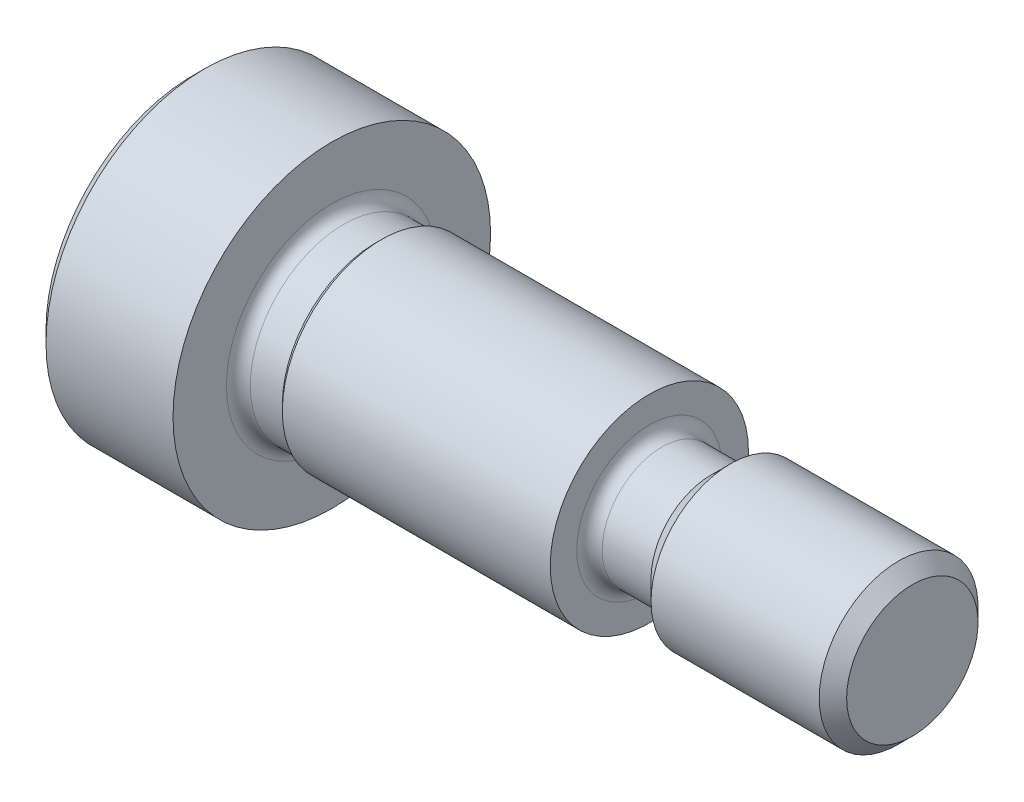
ISO-10303-21;
HEADER;
FILE_DESCRIPTION(('STEP AP214'),'2;1');
FILE_NAME('part.step','',(''),(''),'','','');
FILE_SCHEMA(('AUTOMOTIVE_DESIGN { 1 0 10303 214 1 1 1 1 }'));
ENDSEC;
DATA;
#1=APPLICATION_CONTEXT('core data for automotive mechanical design processes');
#2=APPLICATION_PROTOCOL_DEFINITION('international standard','automotive_design',2000,#1);
#3=PRODUCT_CONTEXT('',#1,'mechanical');
#4=PRODUCT('Part','Part','',(#3));
#5=PRODUCT_RELATED_PRODUCT_CATEGORY('part','',(#4));
#6=PRODUCT_DEFINITION_FORMATION('','',#4);
#7=PRODUCT_DEFINITION_CONTEXT('part definition',#1,'design');
#8=PRODUCT_DEFINITION('design','',#6,#7);
#9=PRODUCT_DEFINITION_SHAPE('','',#8);
#10=(LENGTH_UNIT() NAMED_UNIT(*) SI_UNIT(.MILLI.,.METRE.));
#11=(NAMED_UNIT(*) PLANE_ANGLE_UNIT() SI_UNIT($,.RADIAN.));
#12=(NAMED_UNIT(*) SI_UNIT($,.STERADIAN.) SOLID_ANGLE_UNIT());
#13=UNCERTAINTY_MEASURE_WITH_UNIT(LENGTH_MEASURE(1.E-05),#10,'distance_accuracy_value','');
#14=(GEOMETRIC_REPRESENTATION_CONTEXT(3) GLOBAL_UNCERTAINTY_ASSIGNED_CONTEXT((#13)) GLOBAL_UNIT_ASSIGNED_CONTEXT((#10,
#11,#12)) REPRESENTATION_CONTEXT('',''));
#15=CARTESIAN_POINT('',(0.,0.,0.));
#16=DIRECTION('',(0.,0.,1.));
#17=DIRECTION('',(1.,0.,0.));
#18=AXIS2_PLACEMENT_3D('',#15,#16,#17);
#19=CARTESIAN_POINT('',(0.,0.,0.));
#20=DIRECTION('',(-1.,0.,0.));
#21=DIRECTION('',(0.,0.,1.));
#22=AXIS2_PLACEMENT_3D('',#19,#20,#21);
#23=PLANE('',#22);
#24=CARTESIAN_POINT('',(0.,0.,0.));
#25=DIRECTION('',(-1.,0.,0.));
#26=DIRECTION('',(0.,0.,1.));
#27=AXIS2_PLACEMENT_3D('',#24,#25,#26);
#28=CIRCLE('',#27,7.4);
#29=CARTESIAN_POINT('',(0.,0.,-7.4));
#30=VERTEX_POINT('',#29);
#31=EDGE_CURVE('E38',#30,#30,#28,.T.);
#32=ORIENTED_EDGE('',*,*,#31,.T.);
#33=EDGE_LOOP('',(#32));
#34=FACE_BOUND('',#33,.T.);
#35=DIRECTION('',(0.,-0.500000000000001,-0.866025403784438));
#36=VECTOR('',#35,1.);
#37=CARTESIAN_POINT('',(0.,-1.47079981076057,2.5475));
#38=LINE('',#37,#36);
#39=CARTESIAN_POINT('',(0.,-1.47079981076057,2.5475));
#40=VERTEX_POINT('',#39);
#41=CARTESIAN_POINT('',(0.,-2.94159962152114,0.));
#42=VERTEX_POINT('',#41);
#43=EDGE_CURVE('E45',#40,#42,#38,.T.);
#44=ORIENTED_EDGE('',*,*,#43,.T.);
#45=DIRECTION('',(0.,0.5,-0.866025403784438));
#46=VECTOR('',#45,1.);
#47=CARTESIAN_POINT('',(0.,-2.94159962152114,0.));
#48=LINE('',#47,#46);
#49=CARTESIAN_POINT('',(0.,-1.47079981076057,-2.5475));
#50=VERTEX_POINT('',#49);
#51=EDGE_CURVE('E320',#42,#50,#48,.T.);
#52=ORIENTED_EDGE('',*,*,#51,.T.);
#53=DIRECTION('',(0.,1.,0.));
#54=VECTOR('',#53,1.);
#55=CARTESIAN_POINT('',(0.,-1.47079981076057,-2.5475));
#56=LINE('',#55,#54);
#57=CARTESIAN_POINT('',(0.,1.47079981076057,-2.5475));
#58=VERTEX_POINT('',#57);
#59=EDGE_CURVE('E125',#50,#58,#56,.T.);
#60=ORIENTED_EDGE('',*,*,#59,.T.);
#61=DIRECTION('',(0.,0.500000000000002,0.866025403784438));
#62=VECTOR('',#61,1.);
#63=CARTESIAN_POINT('',(0.,1.47079981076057,-2.5475));
#64=LINE('',#63,#62);
#65=CARTESIAN_POINT('',(0.,2.94159962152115,0.));
#66=VERTEX_POINT('',#65);
#67=EDGE_CURVE('E323',#58,#66,#64,.T.);
#68=ORIENTED_EDGE('',*,*,#67,.T.);
#69=DIRECTION('',(0.,-0.500000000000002,0.866025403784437));
#70=VECTOR('',#69,1.);
#71=CARTESIAN_POINT('',(0.,2.94159962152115,0.));
#72=LINE('',#71,#70);
#73=CARTESIAN_POINT('',(0.,1.47079981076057,2.5475));
#74=VERTEX_POINT('',#73);
#75=EDGE_CURVE('E325',#66,#74,#72,.T.);
#76=ORIENTED_EDGE('',*,*,#75,.T.);
#77=DIRECTION('',(0.,-1.,0.));
#78=VECTOR('',#77,1.);
#79=CARTESIAN_POINT('',(0.,1.47079981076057,2.5475));
#80=LINE('',#79,#78);
#81=EDGE_CURVE('E327',#74,#40,#80,.T.);
#82=ORIENTED_EDGE('',*,*,#81,.T.);
#83=EDGE_LOOP('',(#44,#52,#60,#68,#76,#82));
#84=FACE_BOUND('',#83,.T.);
#85=ADVANCED_FACE('F30',(#34,#84),#23,.T.);
#86=CARTESIAN_POINT('',(-6.34999999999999,0.,0.));
#87=DIRECTION('',(-1.,0.,0.));
#88=DIRECTION('',(0.,0.,1.));
#89=AXIS2_PLACEMENT_3D('',#86,#87,#88);
#90=CYLINDRICAL_SURFACE('',#89,8.);
#91=CARTESIAN_POINT('',(0.600000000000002,0.,0.));
#92=DIRECTION('',(-1.,0.,0.));
#93=DIRECTION('',(0.,0.,1.));
#94=AXIS2_PLACEMENT_3D('',#91,#92,#93);
#95=CIRCLE('',#94,8.);
#96=CARTESIAN_POINT('',(0.600000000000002,0.,-8.));
#97=VERTEX_POINT('',#96);
#98=EDGE_CURVE('E11',#97,#97,#95,.F.);
#99=ORIENTED_EDGE('',*,*,#98,.T.);
#100=EDGE_LOOP('',(#99));
#101=FACE_BOUND('',#100,.T.);
#102=CARTESIAN_POINT('',(7.,0.,0.));
#103=DIRECTION('',(-1.,0.,0.));
#104=DIRECTION('',(0.,0.,1.));
#105=AXIS2_PLACEMENT_3D('',#102,#103,#104);
#106=CIRCLE('',#105,8.);
#107=CARTESIAN_POINT('',(7.,0.,8.));
#108=VERTEX_POINT('',#107);
#109=EDGE_CURVE('E172',#108,#108,#106,.T.);
#110=ORIENTED_EDGE('',*,*,#109,.T.);
#111=EDGE_LOOP('',(#110));
#112=FACE_BOUND('',#111,.T.);
#113=ADVANCED_FACE('F191',(#101,#112),#90,.T.);
#114=CARTESIAN_POINT('',(7.,8.,0.));
#115=DIRECTION('',(1.,0.,0.));
#116=DIRECTION('',(0.,0.,-1.));
#117=AXIS2_PLACEMENT_3D('',#114,#115,#116);
#118=PLANE('',#117);
#119=CARTESIAN_POINT('',(7.,0.,0.));
#120=DIRECTION('',(-1.,0.,0.));
#121=DIRECTION('',(0.,0.,1.));
#122=AXIS2_PLACEMENT_3D('',#119,#120,#121);
#123=CIRCLE('',#122,5.31);
#124=CARTESIAN_POINT('',(7.,0.,5.31));
#125=VERTEX_POINT('',#124);
#126=EDGE_CURVE('E169',#125,#125,#123,.T.);
#127=ORIENTED_EDGE('',*,*,#126,.T.);
#128=EDGE_LOOP('',(#127));
#129=FACE_BOUND('',#128,.T.);
#130=ORIENTED_EDGE('',*,*,#109,.F.);
#131=EDGE_LOOP('',(#130));
#132=FACE_BOUND('',#131,.T.);
#133=ADVANCED_FACE('F195',(#129,#132),#118,.T.);
#134=CARTESIAN_POINT('',(7.6,0.,0.));
#135=DIRECTION('',(-1.,0.,0.));
#136=DIRECTION('',(0.,0.,1.));
#137=AXIS2_PLACEMENT_3D('',#134,#135,#136);
#138=TOROIDAL_SURFACE('',#137,5.31,0.6);
#139=ORIENTED_EDGE('',*,*,#126,.F.);
#140=EDGE_LOOP('',(#139));
#141=FACE_BOUND('',#140,.T.);
#142=CARTESIAN_POINT('',(7.6,0.,0.));
#143=DIRECTION('',(-1.,0.,0.));
#144=DIRECTION('',(0.,0.,1.));
#145=AXIS2_PLACEMENT_3D('',#142,#143,#144);
#146=CIRCLE('',#145,4.71);
#147=CARTESIAN_POINT('',(7.6,0.,4.71));
#148=VERTEX_POINT('',#147);
#149=EDGE_CURVE('E166',#148,#148,#146,.T.);
#150=ORIENTED_EDGE('',*,*,#149,.T.);
#151=EDGE_LOOP('',(#150));
#152=FACE_BOUND('',#151,.T.);
#153=ADVANCED_FACE('F201',(#141,#152),#138,.F.);
#154=CARTESIAN_POINT('',(-6.34999999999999,0.,0.));
#155=DIRECTION('',(-1.,0.,0.));
#156=DIRECTION('',(0.,0.,1.));
#157=AXIS2_PLACEMENT_3D('',#154,#155,#156);
#158=CYLINDRICAL_SURFACE('',#157,4.71);
#159=CARTESIAN_POINT('',(9.2165,0.,0.));
#160=DIRECTION('',(-1.,0.,0.));
#161=DIRECTION('',(0.,0.,1.));
#162=AXIS2_PLACEMENT_3D('',#159,#160,#161);
#163=CIRCLE('',#162,4.71);
#164=CARTESIAN_POINT('',(9.2165,0.,4.71));
#165=VERTEX_POINT('',#164);
#166=EDGE_CURVE('E163',#165,#165,#163,.T.);
#167=ORIENTED_EDGE('',*,*,#166,.T.);
#168=EDGE_LOOP('',(#167));
#169=FACE_BOUND('',#168,.T.);
#170=ORIENTED_EDGE('',*,*,#149,.F.);
#171=EDGE_LOOP('',(#170));
#172=FACE_BOUND('',#171,.T.);
#173=ADVANCED_FACE('F205',(#169,#172),#158,.T.);
#174=CARTESIAN_POINT('',(9.2165,0.,0.));
#175=DIRECTION('',(1.,0.,0.));
#176=DIRECTION('',(0.,0.,-1.));
#177=AXIS2_PLACEMENT_3D('',#174,#175,#176);
#178=CONICAL_SURFACE('',#177,4.71,0.785398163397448);
#179=CARTESIAN_POINT('',(9.5,0.,0.));
#180=DIRECTION('',(-1.,0.,0.));
#181=DIRECTION('',(0.,0.,1.));
#182=AXIS2_PLACEMENT_3D('',#179,#180,#181);
#183=CIRCLE('',#182,4.9935);
#184=CARTESIAN_POINT('',(9.5,0.,4.9935));
#185=VERTEX_POINT('',#184);
#186=EDGE_CURVE('E160',#185,#185,#183,.T.);
#187=ORIENTED_EDGE('',*,*,#186,.T.);
#188=EDGE_LOOP('',(#187));
#189=FACE_BOUND('',#188,.T.);
#190=ORIENTED_EDGE('',*,*,#166,.F.);
#191=EDGE_LOOP('',(#190));
#192=FACE_BOUND('',#191,.T.);
#193=ADVANCED_FACE('F209',(#189,#192),#178,.T.);
#194=CARTESIAN_POINT('',(-6.34999999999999,0.,0.));
#195=DIRECTION('',(-1.,0.,0.));
#196=DIRECTION('',(0.,0.,1.));
#197=AXIS2_PLACEMENT_3D('',#194,#195,#196);
#198=CYLINDRICAL_SURFACE('',#197,4.9935);
#199=CARTESIAN_POINT('',(23.,0.,0.));
#200=DIRECTION('',(-1.,0.,0.));
#201=DIRECTION('',(0.,0.,1.));
#202=AXIS2_PLACEMENT_3D('',#199,#200,#201);
#203=CIRCLE('',#202,4.9935);
#204=CARTESIAN_POINT('',(23.,0.,4.9935));
#205=VERTEX_POINT('',#204);
#206=EDGE_CURVE('E157',#205,#205,#203,.T.);
#207=ORIENTED_EDGE('',*,*,#206,.T.);
#208=EDGE_LOOP('',(#207));
#209=FACE_BOUND('',#208,.T.);
#210=ORIENTED_EDGE('',*,*,#186,.F.);
#211=EDGE_LOOP('',(#210));
#212=FACE_BOUND('',#211,.T.);
#213=ADVANCED_FACE('F213',(#209,#212),#198,.T.);
#214=CARTESIAN_POINT('',(23.,4.9935,0.));
#215=DIRECTION('',(1.,0.,0.));
#216=DIRECTION('',(0.,0.,-1.));
#217=AXIS2_PLACEMENT_3D('',#214,#215,#216);
#218=PLANE('',#217);
#219=CARTESIAN_POINT('',(23.,0.,0.));
#220=DIRECTION('',(-1.,0.,0.));
#221=DIRECTION('',(0.,0.,1.));
#222=AXIS2_PLACEMENT_3D('',#219,#220,#221);
#223=CIRCLE('',#222,3.655);
#224=CARTESIAN_POINT('',(23.,0.,3.655));
#225=VERTEX_POINT('',#224);
#226=EDGE_CURVE('E154',#225,#225,#223,.T.);
#227=ORIENTED_EDGE('',*,*,#226,.T.);
#228=EDGE_LOOP('',(#227));
#229=FACE_BOUND('',#228,.T.);
#230=ORIENTED_EDGE('',*,*,#206,.F.);
#231=EDGE_LOOP('',(#230));
#232=FACE_BOUND('',#231,.T.);
#233=ADVANCED_FACE('F217',(#229,#232),#218,.T.);
#234=CARTESIAN_POINT('',(23.64,0.,0.));
#235=DIRECTION('',(-1.,0.,0.));
#236=DIRECTION('',(0.,0.,1.));
#237=AXIS2_PLACEMENT_3D('',#234,#235,#236);
#238=TOROIDAL_SURFACE('',#237,3.655,0.640000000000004);
#239=CARTESIAN_POINT('',(23.64,0.,0.));
#240=DIRECTION('',(-1.,0.,0.));
#241=DIRECTION('',(0.,0.,1.));
#242=AXIS2_PLACEMENT_3D('',#239,#240,#241);
#243=CIRCLE('',#242,3.015);
#244=CARTESIAN_POINT('',(23.64,0.,3.015));
#245=VERTEX_POINT('',#244);
#246=EDGE_CURVE('E151',#245,#245,#243,.T.);
#247=ORIENTED_EDGE('',*,*,#246,.T.);
#248=EDGE_LOOP('',(#247));
#249=FACE_BOUND('',#248,.T.);
#250=ORIENTED_EDGE('',*,*,#226,.F.);
#251=EDGE_LOOP('',(#250));
#252=FACE_BOUND('',#251,.T.);
#253=ADVANCED_FACE('F221',(#249,#252),#238,.F.);
#254=CARTESIAN_POINT('',(-6.34999999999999,0.,0.));
#255=DIRECTION('',(-1.,0.,0.));
#256=DIRECTION('',(0.,0.,1.));
#257=AXIS2_PLACEMENT_3D('',#254,#255,#256);
#258=CYLINDRICAL_SURFACE('',#257,3.015);
#259=CARTESIAN_POINT('',(26.1,0.,0.));
#260=DIRECTION('',(-1.,0.,0.));
#261=DIRECTION('',(0.,0.,1.));
#262=AXIS2_PLACEMENT_3D('',#259,#260,#261);
#263=CIRCLE('',#262,3.015);
#264=CARTESIAN_POINT('',(26.1,0.,3.015));
#265=VERTEX_POINT('',#264);
#266=EDGE_CURVE('E148',#265,#265,#263,.T.);
#267=ORIENTED_EDGE('',*,*,#266,.T.);
#268=EDGE_LOOP('',(#267));
#269=FACE_BOUND('',#268,.T.);
#270=ORIENTED_EDGE('',*,*,#246,.F.);
#271=EDGE_LOOP('',(#270));
#272=FACE_BOUND('',#271,.T.);
#273=ADVANCED_FACE('F225',(#269,#272),#258,.T.);
#274=CARTESIAN_POINT('',(26.1,0.,0.));
#275=DIRECTION('',(1.,0.,0.));
#276=DIRECTION('',(0.,0.,-1.));
#277=AXIS2_PLACEMENT_3D('',#274,#275,#276);
#278=CONICAL_SURFACE('',#277,3.015,0.785398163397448);
#279=CARTESIAN_POINT('',(27.085,0.,0.));
#280=DIRECTION('',(-1.,0.,0.));
#281=DIRECTION('',(0.,0.,1.));
#282=AXIS2_PLACEMENT_3D('',#279,#280,#281);
#283=CIRCLE('',#282,4.);
#284=CARTESIAN_POINT('',(27.085,0.,4.));
#285=VERTEX_POINT('',#284);
#286=EDGE_CURVE('E145',#285,#285,#283,.T.);
#287=ORIENTED_EDGE('',*,*,#286,.T.);
#288=EDGE_LOOP('',(#287));
#289=FACE_BOUND('',#288,.T.);
#290=ORIENTED_EDGE('',*,*,#266,.F.);
#291=EDGE_LOOP('',(#290));
#292=FACE_BOUND('',#291,.T.);
#293=ADVANCED_FACE('F229',(#289,#292),#278,.T.);
#294=CARTESIAN_POINT('',(-6.34999999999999,0.,0.));
#295=DIRECTION('',(-1.,0.,0.));
#296=DIRECTION('',(0.,0.,1.));
#297=AXIS2_PLACEMENT_3D('',#294,#295,#296);
#298=CYLINDRICAL_SURFACE('',#297,4.);
#299=CARTESIAN_POINT('',(35.5595,0.,0.));
#300=DIRECTION('',(-1.,0.,0.));
#301=DIRECTION('',(0.,0.,1.));
#302=AXIS2_PLACEMENT_3D('',#299,#300,#301);
#303=CIRCLE('',#302,4.);
#304=CARTESIAN_POINT('',(35.5595,0.,4.));
#305=VERTEX_POINT('',#304);
#306=EDGE_CURVE('E142',#305,#305,#303,.T.);
#307=ORIENTED_EDGE('',*,*,#306,.T.);
#308=EDGE_LOOP('',(#307));
#309=FACE_BOUND('',#308,.T.);
#310=ORIENTED_EDGE('',*,*,#286,.F.);
#311=EDGE_LOOP('',(#310));
#312=FACE_BOUND('',#311,.T.);
#313=ADVANCED_FACE('F233',(#309,#312),#298,.T.);
#314=CARTESIAN_POINT('',(35.5595,0.,0.));
#315=DIRECTION('',(-1.,0.,0.));
#316=DIRECTION('',(0.,0.,1.));
#317=AXIS2_PLACEMENT_3D('',#314,#315,#316);
#318=CONICAL_SURFACE('',#317,4.,0.785398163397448);
#319=CARTESIAN_POINT('',(36.25,0.,0.));
#320=DIRECTION('',(-1.,0.,0.));
#321=DIRECTION('',(0.,0.,1.));
#322=AXIS2_PLACEMENT_3D('',#319,#320,#321);
#323=CIRCLE('',#322,3.3095);
#324=CARTESIAN_POINT('',(36.25,0.,3.3095));
#325=VERTEX_POINT('',#324);
#326=EDGE_CURVE('E138',#325,#325,#323,.T.);
#327=ORIENTED_EDGE('',*,*,#326,.T.);
#328=EDGE_LOOP('',(#327));
#329=FACE_BOUND('',#328,.T.);
#330=ORIENTED_EDGE('',*,*,#306,.F.);
#331=EDGE_LOOP('',(#330));
#332=FACE_BOUND('',#331,.T.);
#333=ADVANCED_FACE('F186',(#329,#332),#318,.T.);
#334=CARTESIAN_POINT('',(36.25,3.3095,0.));
#335=DIRECTION('',(1.,0.,0.));
#336=DIRECTION('',(0.,0.,-1.));
#337=AXIS2_PLACEMENT_3D('',#334,#335,#336);
#338=PLANE('',#337);
#339=ORIENTED_EDGE('',*,*,#326,.F.);
#340=EDGE_LOOP('',(#339));
#341=FACE_BOUND('',#340,.T.);
#342=ADVANCED_FACE('F179',(#341),#338,.T.);
#343=CARTESIAN_POINT('',(0.,0.,0.));
#344=DIRECTION('',(1.,0.,0.));
#345=DIRECTION('',(0.,0.,-1.));
#346=AXIS2_PLACEMENT_3D('',#343,#344,#345);
#347=CONICAL_SURFACE('',#346,7.4,0.785398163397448);
#348=CARTESIAN_POINT('',(0.600000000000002,0.,-8.));
#349=CARTESIAN_POINT('',(0.593750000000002,0.,-7.99375));
#350=CARTESIAN_POINT('',(0.587500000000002,0.,-7.9875));
#351=CARTESIAN_POINT('',(0.575000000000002,0.,-7.975));
#352=CARTESIAN_POINT('',(0.568750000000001,0.,-7.96875));
#353=CARTESIAN_POINT('',(0.556250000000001,0.,-7.95625));
#354=CARTESIAN_POINT('',(0.550000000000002,0.,-7.95));
#355=CARTESIAN_POINT('',(0.537500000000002,0.,-7.9375));
#356=CARTESIAN_POINT('',(0.531250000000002,0.,-7.93125));
#357=CARTESIAN_POINT('',(0.518750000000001,0.,-7.91875));
#358=CARTESIAN_POINT('',(0.512500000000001,0.,-7.9125));
#359=CARTESIAN_POINT('',(0.500000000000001,0.,-7.9));
#360=CARTESIAN_POINT('',(0.493750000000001,0.,-7.89375));
#361=CARTESIAN_POINT('',(0.481250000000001,0.,-7.88125));
#362=CARTESIAN_POINT('',(0.475000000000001,0.,-7.875));
#363=CARTESIAN_POINT('',(0.462500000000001,0.,-7.8625));
#364=CARTESIAN_POINT('',(0.456250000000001,0.,-7.85625));
#365=CARTESIAN_POINT('',(0.443750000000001,0.,-7.84375));
#366=CARTESIAN_POINT('',(0.437500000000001,0.,-7.8375));
#367=CARTESIAN_POINT('',(0.425000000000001,0.,-7.825));
#368=CARTESIAN_POINT('',(0.418750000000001,0.,-7.81875));
#369=CARTESIAN_POINT('',(0.406250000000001,0.,-7.80625));
#370=CARTESIAN_POINT('',(0.400000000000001,0.,-7.8));
#371=CARTESIAN_POINT('',(0.387500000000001,0.,-7.7875));
#372=CARTESIAN_POINT('',(0.381250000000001,0.,-7.78125));
#373=CARTESIAN_POINT('',(0.368750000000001,0.,-7.76875));
#374=CARTESIAN_POINT('',(0.362500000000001,0.,-7.7625));
#375=CARTESIAN_POINT('',(0.350000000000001,0.,-7.75));
#376=CARTESIAN_POINT('',(0.343750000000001,0.,-7.74375));
#377=CARTESIAN_POINT('',(0.331250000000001,0.,-7.73125));
#378=CARTESIAN_POINT('',(0.325000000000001,0.,-7.725));
#379=CARTESIAN_POINT('',(0.312500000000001,0.,-7.7125));
#380=CARTESIAN_POINT('',(0.306250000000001,0.,-7.70625));
#381=CARTESIAN_POINT('',(0.293750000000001,0.,-7.69375));
#382=CARTESIAN_POINT('',(0.287500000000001,0.,-7.6875));
#383=CARTESIAN_POINT('',(0.275000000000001,0.,-7.675));
#384=CARTESIAN_POINT('',(0.268750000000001,0.,-7.66875));
#385=CARTESIAN_POINT('',(0.256250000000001,0.,-7.65625));
#386=CARTESIAN_POINT('',(0.250000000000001,0.,-7.65));
#387=CARTESIAN_POINT('',(0.237500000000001,0.,-7.6375));
#388=CARTESIAN_POINT('',(0.231250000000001,0.,-7.63125));
#389=CARTESIAN_POINT('',(0.218750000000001,0.,-7.61875));
#390=CARTESIAN_POINT('',(0.2125,0.,-7.6125));
#391=CARTESIAN_POINT('',(0.200000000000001,0.,-7.6));
#392=CARTESIAN_POINT('',(0.193750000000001,0.,-7.59375));
#393=CARTESIAN_POINT('',(0.181250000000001,0.,-7.58125));
#394=CARTESIAN_POINT('',(0.175,0.,-7.575));
#395=CARTESIAN_POINT('',(0.1625,0.,-7.5625));
#396=CARTESIAN_POINT('',(0.15625,0.,-7.55625));
#397=CARTESIAN_POINT('',(0.143750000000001,0.,-7.54375));
#398=CARTESIAN_POINT('',(0.1375,0.,-7.5375));
#399=CARTESIAN_POINT('',(0.125,0.,-7.525));
#400=CARTESIAN_POINT('',(0.11875,0.,-7.51875));
#401=CARTESIAN_POINT('',(0.10625,0.,-7.50625));
#402=CARTESIAN_POINT('',(0.1,0.,-7.5));
#403=CARTESIAN_POINT('',(0.0875000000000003,0.,-7.4875));
#404=CARTESIAN_POINT('',(0.0812500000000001,0.,-7.48125));
#405=CARTESIAN_POINT('',(0.0687500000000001,0.,-7.46875));
#406=CARTESIAN_POINT('',(0.0625000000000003,0.,-7.4625));
#407=CARTESIAN_POINT('',(0.0500000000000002,0.,-7.45));
#408=CARTESIAN_POINT('',(0.0437500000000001,0.,-7.44375));
#409=CARTESIAN_POINT('',(0.03125,0.,-7.43125));
#410=CARTESIAN_POINT('',(0.0250000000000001,0.,-7.425));
#411=CARTESIAN_POINT('',(0.0125000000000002,0.,-7.4125));
#412=CARTESIAN_POINT('',(0.00625000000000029,0.,-7.40625));
#413=CARTESIAN_POINT('',(0.,0.,-7.4));
#414=B_SPLINE_CURVE_WITH_KNOTS('',3,(#348,#349,#350,#351,#352,#353,#354,#355,#356,#357,#358,
#359,#360,#361,#362,#363,#364,#365,#366,#367,#368,#369,#370,#371,#372,#373,#374,#375,#376,#377,
#378,#379,#380,#381,#382,#383,#384,#385,#386,#387,#388,#389,#390,#391,#392,#393,#394,#395,#396,
#397,#398,#399,#400,#401,#402,#403,#404,#405,#406,#407,#408,#409,#410,#411,#412,#413),
.UNSPECIFIED.,.F.,.F.,(4,2,2,2,2,2,2,2,2,2,2,2,2,2,2,2,2,2,2,2,2,2,2,2,2,2,2,2,2,2,2,2,4),(0.,
0.0265165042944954,0.0530330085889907,0.0795495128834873,0.106066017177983,0.132582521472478,
0.159099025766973,0.185615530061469,0.212132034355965,0.23864853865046,0.265165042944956,
0.291681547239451,0.318198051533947,0.344714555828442,0.371231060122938,0.397747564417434,
0.424264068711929,0.450780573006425,0.47729707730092,0.503813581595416,0.530330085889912,
0.556846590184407,0.583363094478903,0.609879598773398,0.636396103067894,0.66291260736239,
0.689429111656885,0.715945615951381,0.742462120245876,0.768978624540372,0.795495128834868,
0.822011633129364,0.848528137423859),.UNSPECIFIED.);
#415=EDGE_CURVE('BSEAM32',#97,#30,#414,.T.);
#416=ORIENTED_EDGE('',*,*,#98,.F.);
#417=ORIENTED_EDGE('',*,*,#31,.F.);
#418=ORIENTED_EDGE('',*,*,#415,.T.);
#419=ORIENTED_EDGE('',*,*,#415,.F.);
#420=EDGE_LOOP('',(#416,#418,#417,#419));
#421=FACE_BOUND('',#420,.T.);
#422=ADVANCED_FACE('F32',(#421),#347,.T.);
#423=CARTESIAN_POINT('',(4.2,-2.94159962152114,0.));
#424=DIRECTION('',(0.,0.866025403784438,0.500000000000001));
#425=DIRECTION('',(0.,-0.500000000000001,0.866025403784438));
#426=AXIS2_PLACEMENT_3D('',#423,#424,#425);
#427=PLANE('',#426);
#428=DIRECTION('',(0.,0.5,-0.866025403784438));
#429=VECTOR('',#428,1.);
#430=CARTESIAN_POINT('',(4.2,-2.94159962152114,0.));
#431=LINE('',#430,#429);
#432=CARTESIAN_POINT('',(4.2,-2.94159962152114,0.));
#433=VERTEX_POINT('',#432);
#434=CARTESIAN_POINT('',(4.2,-2.20619971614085,-1.27375));
#435=VERTEX_POINT('',#434);
#436=EDGE_CURVE('E53',#433,#435,#431,.T.);
#437=ORIENTED_EDGE('',*,*,#436,.T.);
#438=CARTESIAN_POINT('',(4.2,-1.47079981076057,-2.5475));
#439=VERTEX_POINT('',#438);
#440=EDGE_CURVE('E103',#435,#439,#431,.T.);
#441=ORIENTED_EDGE('',*,*,#440,.T.);
#442=DIRECTION('',(-1.,0.,0.));
#443=VECTOR('',#442,1.);
#444=CARTESIAN_POINT('',(4.2,-1.47079981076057,-2.5475));
#445=LINE('',#444,#443);
#446=EDGE_CURVE('E107',#439,#50,#445,.T.);
#447=ORIENTED_EDGE('',*,*,#446,.T.);
#448=ORIENTED_EDGE('',*,*,#51,.F.);
#449=DIRECTION('',(-1.,0.,0.));
#450=VECTOR('',#449,1.);
#451=CARTESIAN_POINT('',(4.2,-2.94159962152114,0.));
#452=LINE('',#451,#450);
#453=EDGE_CURVE('E319',#433,#42,#452,.T.);
#454=ORIENTED_EDGE('',*,*,#453,.F.);
#455=EDGE_LOOP('',(#437,#441,#447,#448,#454));
#456=FACE_BOUND('',#455,.T.);
#457=ADVANCED_FACE('F105',(#456),#427,.T.);
#458=CARTESIAN_POINT('',(4.2,-1.47079981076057,-2.5475));
#459=DIRECTION('',(0.,0.,1.));
#460=DIRECTION('',(0.,-1.,0.));
#461=AXIS2_PLACEMENT_3D('',#458,#459,#460);
#462=PLANE('',#461);
#463=DIRECTION('',(0.,1.,0.));
#464=VECTOR('',#463,1.);
#465=CARTESIAN_POINT('',(4.2,-1.47079981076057,-2.5475));
#466=LINE('',#465,#464);
#467=CARTESIAN_POINT('',(4.2,0.,-2.5475));
#468=VERTEX_POINT('',#467);
#469=EDGE_CURVE('E112',#439,#468,#466,.T.);
#470=ORIENTED_EDGE('',*,*,#469,.T.);
#471=CARTESIAN_POINT('',(4.2,1.47079981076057,-2.5475));
#472=VERTEX_POINT('',#471);
#473=EDGE_CURVE('E120',#468,#472,#466,.T.);
#474=ORIENTED_EDGE('',*,*,#473,.T.);
#475=DIRECTION('',(-1.,0.,0.));
#476=VECTOR('',#475,1.);
#477=CARTESIAN_POINT('',(4.2,1.47079981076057,-2.5475));
#478=LINE('',#477,#476);
#479=EDGE_CURVE('E127',#472,#58,#478,.T.);
#480=ORIENTED_EDGE('',*,*,#479,.T.);
#481=ORIENTED_EDGE('',*,*,#59,.F.);
#482=ORIENTED_EDGE('',*,*,#446,.F.);
#483=EDGE_LOOP('',(#470,#474,#480,#481,#482));
#484=FACE_BOUND('',#483,.T.);
#485=ADVANCED_FACE('F123',(#484),#462,.T.);
#486=CARTESIAN_POINT('',(4.2,1.47079981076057,-2.5475));
#487=DIRECTION('',(0.,-0.866025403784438,0.500000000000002));
#488=DIRECTION('',(0.,-0.500000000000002,-0.866025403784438));
#489=AXIS2_PLACEMENT_3D('',#486,#487,#488);
#490=PLANE('',#489);
#491=DIRECTION('',(0.,0.500000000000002,0.866025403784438));
#492=VECTOR('',#491,1.);
#493=CARTESIAN_POINT('',(4.2,1.47079981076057,-2.5475));
#494=LINE('',#493,#492);
#495=CARTESIAN_POINT('',(4.2,2.20619971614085,-1.27375));
#496=VERTEX_POINT('',#495);
#497=EDGE_CURVE('E283',#472,#496,#494,.T.);
#498=ORIENTED_EDGE('',*,*,#497,.T.);
#499=CARTESIAN_POINT('',(4.2,2.94159962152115,0.));
#500=VERTEX_POINT('',#499);
#501=EDGE_CURVE('E119',#496,#500,#494,.T.);
#502=ORIENTED_EDGE('',*,*,#501,.T.);
#503=DIRECTION('',(-1.,0.,0.));
#504=VECTOR('',#503,1.);
#505=CARTESIAN_POINT('',(4.2,2.94159962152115,0.));
#506=LINE('',#505,#504);
#507=EDGE_CURVE('E133',#500,#66,#506,.T.);
#508=ORIENTED_EDGE('',*,*,#507,.T.);
#509=ORIENTED_EDGE('',*,*,#67,.F.);
#510=ORIENTED_EDGE('',*,*,#479,.F.);
#511=EDGE_LOOP('',(#498,#502,#508,#509,#510));
#512=FACE_BOUND('',#511,.T.);
#513=ADVANCED_FACE('F247',(#512),#490,.T.);
#514=CARTESIAN_POINT('',(4.2,2.94159962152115,0.));
#515=DIRECTION('',(0.,-0.866025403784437,-0.500000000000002));
#516=DIRECTION('',(0.,0.500000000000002,-0.866025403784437));
#517=AXIS2_PLACEMENT_3D('',#514,#515,#516);
#518=PLANE('',#517);
#519=DIRECTION('',(0.,-0.500000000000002,0.866025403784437));
#520=VECTOR('',#519,1.);
#521=CARTESIAN_POINT('',(4.2,2.94159962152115,0.));
#522=LINE('',#521,#520);
#523=CARTESIAN_POINT('',(4.2,2.20619971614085,1.27375));
#524=VERTEX_POINT('',#523);
#525=EDGE_CURVE('E288',#500,#524,#522,.T.);
#526=ORIENTED_EDGE('',*,*,#525,.T.);
#527=CARTESIAN_POINT('',(4.2,1.47079981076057,2.5475));
#528=VERTEX_POINT('',#527);
#529=EDGE_CURVE('E294',#524,#528,#522,.T.);
#530=ORIENTED_EDGE('',*,*,#529,.T.);
#531=DIRECTION('',(-1.,0.,0.));
#532=VECTOR('',#531,1.);
#533=CARTESIAN_POINT('',(4.2,1.47079981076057,2.5475));
#534=LINE('',#533,#532);
#535=EDGE_CURVE('E314',#528,#74,#534,.T.);
#536=ORIENTED_EDGE('',*,*,#535,.T.);
#537=ORIENTED_EDGE('',*,*,#75,.F.);
#538=ORIENTED_EDGE('',*,*,#507,.F.);
#539=EDGE_LOOP('',(#526,#530,#536,#537,#538));
#540=FACE_BOUND('',#539,.T.);
#541=ADVANCED_FACE('F250',(#540),#518,.T.);
#542=CARTESIAN_POINT('',(4.2,1.47079981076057,2.5475));
#543=DIRECTION('',(0.,0.,-1.));
#544=DIRECTION('',(-1.,0.,0.));
#545=AXIS2_PLACEMENT_3D('',#542,#543,#544);
#546=PLANE('',#545);
#547=DIRECTION('',(0.,-1.,0.));
#548=VECTOR('',#547,1.);
#549=CARTESIAN_POINT('',(4.2,1.47079981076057,2.5475));
#550=LINE('',#549,#548);
#551=CARTESIAN_POINT('',(4.2,0.,2.5475));
#552=VERTEX_POINT('',#551);
#553=EDGE_CURVE('E301',#528,#552,#550,.T.);
#554=ORIENTED_EDGE('',*,*,#553,.T.);
#555=CARTESIAN_POINT('',(4.2,-1.47079981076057,2.5475));
#556=VERTEX_POINT('',#555);
#557=EDGE_CURVE('E304',#552,#556,#550,.T.);
#558=ORIENTED_EDGE('',*,*,#557,.T.);
#559=DIRECTION('',(-1.,0.,0.));
#560=VECTOR('',#559,1.);
#561=CARTESIAN_POINT('',(4.2,-1.47079981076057,2.5475));
#562=LINE('',#561,#560);
#563=EDGE_CURVE('E332',#556,#40,#562,.T.);
#564=ORIENTED_EDGE('',*,*,#563,.T.);
#565=ORIENTED_EDGE('',*,*,#81,.F.);
#566=ORIENTED_EDGE('',*,*,#535,.F.);
#567=EDGE_LOOP('',(#554,#558,#564,#565,#566));
#568=FACE_BOUND('',#567,.T.);
#569=ADVANCED_FACE('F254',(#568),#546,.T.);
#570=CARTESIAN_POINT('',(4.2,-1.47079981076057,2.5475));
#571=DIRECTION('',(0.,0.866025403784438,-0.500000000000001));
#572=DIRECTION('',(0.,0.500000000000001,0.866025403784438));
#573=AXIS2_PLACEMENT_3D('',#570,#571,#572);
#574=PLANE('',#573);
#575=DIRECTION('',(0.,-0.500000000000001,-0.866025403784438));
#576=VECTOR('',#575,1.);
#577=CARTESIAN_POINT('',(4.2,-1.47079981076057,2.5475));
#578=LINE('',#577,#576);
#579=CARTESIAN_POINT('',(4.2,-2.20619971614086,1.27375));
#580=VERTEX_POINT('',#579);
#581=EDGE_CURVE('E307',#556,#580,#578,.T.);
#582=ORIENTED_EDGE('',*,*,#581,.T.);
#583=EDGE_CURVE('E315',#580,#433,#578,.T.);
#584=ORIENTED_EDGE('',*,*,#583,.T.);
#585=ORIENTED_EDGE('',*,*,#453,.T.);
#586=ORIENTED_EDGE('',*,*,#43,.F.);
#587=ORIENTED_EDGE('',*,*,#563,.F.);
#588=EDGE_LOOP('',(#582,#584,#585,#586,#587));
#589=FACE_BOUND('',#588,.T.);
#590=ADVANCED_FACE('F258',(#589),#574,.T.);
#591=CARTESIAN_POINT('',(4.2,0.,-5.09499999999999));
#592=DIRECTION('',(1.,0.,0.));
#593=DIRECTION('',(0.,0.,-1.));
#594=AXIS2_PLACEMENT_3D('',#591,#592,#593);
#595=PLANE('',#594);
#596=CARTESIAN_POINT('',(4.2,0.,0.));
#597=DIRECTION('',(-1.,0.,0.));
#598=DIRECTION('',(0.,0.,1.));
#599=AXIS2_PLACEMENT_3D('',#596,#597,#598);
#600=CIRCLE('',#599,2.5475);
#601=EDGE_CURVE('E280',#496,#468,#600,.T.);
#602=ORIENTED_EDGE('',*,*,#601,.F.);
#603=ORIENTED_EDGE('',*,*,#497,.F.);
#604=ORIENTED_EDGE('',*,*,#473,.F.);
#605=EDGE_LOOP('',(#602,#603,#604));
#606=FACE_BOUND('',#605,.T.);
#607=ADVANCED_FACE('F262',(#606),#595,.F.);
#608=EDGE_CURVE('E139',#524,#496,#600,.T.);
#609=ORIENTED_EDGE('',*,*,#608,.F.);
#610=ORIENTED_EDGE('',*,*,#525,.F.);
#611=ORIENTED_EDGE('',*,*,#501,.F.);
#612=EDGE_LOOP('',(#609,#610,#611));
#613=FACE_BOUND('',#612,.T.);
#614=ADVANCED_FACE('F272',(#613),#595,.F.);
#615=EDGE_CURVE('E132',#552,#524,#600,.T.);
#616=ORIENTED_EDGE('',*,*,#615,.F.);
#617=ORIENTED_EDGE('',*,*,#553,.F.);
#618=ORIENTED_EDGE('',*,*,#529,.F.);
#619=EDGE_LOOP('',(#616,#617,#618));
#620=FACE_BOUND('',#619,.T.);
#621=ADVANCED_FACE('F277',(#620),#595,.F.);
#622=EDGE_CURVE('E126',#580,#552,#600,.T.);
#623=ORIENTED_EDGE('',*,*,#622,.F.);
#624=ORIENTED_EDGE('',*,*,#581,.F.);
#625=ORIENTED_EDGE('',*,*,#557,.F.);
#626=EDGE_LOOP('',(#623,#624,#625));
#627=FACE_BOUND('',#626,.T.);
#628=ADVANCED_FACE('F269',(#627),#595,.F.);
#629=EDGE_CURVE('E130',#435,#580,#600,.T.);
#630=ORIENTED_EDGE('',*,*,#629,.F.);
#631=ORIENTED_EDGE('',*,*,#436,.F.);
#632=ORIENTED_EDGE('',*,*,#583,.F.);
#633=EDGE_LOOP('',(#630,#631,#632));
#634=FACE_BOUND('',#633,.T.);
#635=ADVANCED_FACE('F265',(#634),#595,.F.);
#636=EDGE_CURVE('E115',#468,#435,#600,.T.);
#637=ORIENTED_EDGE('',*,*,#636,.F.);
#638=ORIENTED_EDGE('',*,*,#469,.F.);
#639=ORIENTED_EDGE('',*,*,#440,.F.);
#640=EDGE_LOOP('',(#637,#638,#639));
#641=FACE_BOUND('',#640,.T.);
#642=ADVANCED_FACE('F113',(#641),#595,.F.);
#643=CARTESIAN_POINT('',(5.67079981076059,0.,0.));
#644=DIRECTION('',(-1.,0.,0.));
#645=DIRECTION('',(0.,0.,1.));
#646=AXIS2_PLACEMENT_3D('',#643,#644,#645);
#647=CONICAL_SURFACE('',#646,0.,1.04719755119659);
#648=ORIENTED_EDGE('',*,*,#615,.T.);
#649=ORIENTED_EDGE('',*,*,#608,.T.);
#650=ORIENTED_EDGE('',*,*,#601,.T.);
#651=ORIENTED_EDGE('',*,*,#636,.T.);
#652=ORIENTED_EDGE('',*,*,#629,.T.);
#653=ORIENTED_EDGE('',*,*,#622,.T.);
#654=EDGE_LOOP('',(#648,#649,#650,#651,#652,#653));
#655=FACE_BOUND('',#654,.T.);
#656=CARTESIAN_POINT('',(5.67079981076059,0.,0.));
#657=VERTEX_POINT('',#656);
#658=VERTEX_LOOP('',#657);
#659=FACE_BOUND('',#658,.T.);
#660=ADVANCED_FACE('F241',(#655,#659),#647,.F.);
#661=CLOSED_SHELL('',(#85,#113,#133,#153,#173,#193,#213,#233,#253,#273,#293,#313,#333,#342,#422,
#457,#485,#513,#541,#569,#590,#607,#614,#621,#628,#635,#642,#660));
#662=MANIFOLD_SOLID_BREP('B2',#661);
#663=ADVANCED_BREP_SHAPE_REPRESENTATION('',(#18,#662),#14);
#664=SHAPE_DEFINITION_REPRESENTATION(#9,#663);
ENDSEC;
END-ISO-10303-21;
